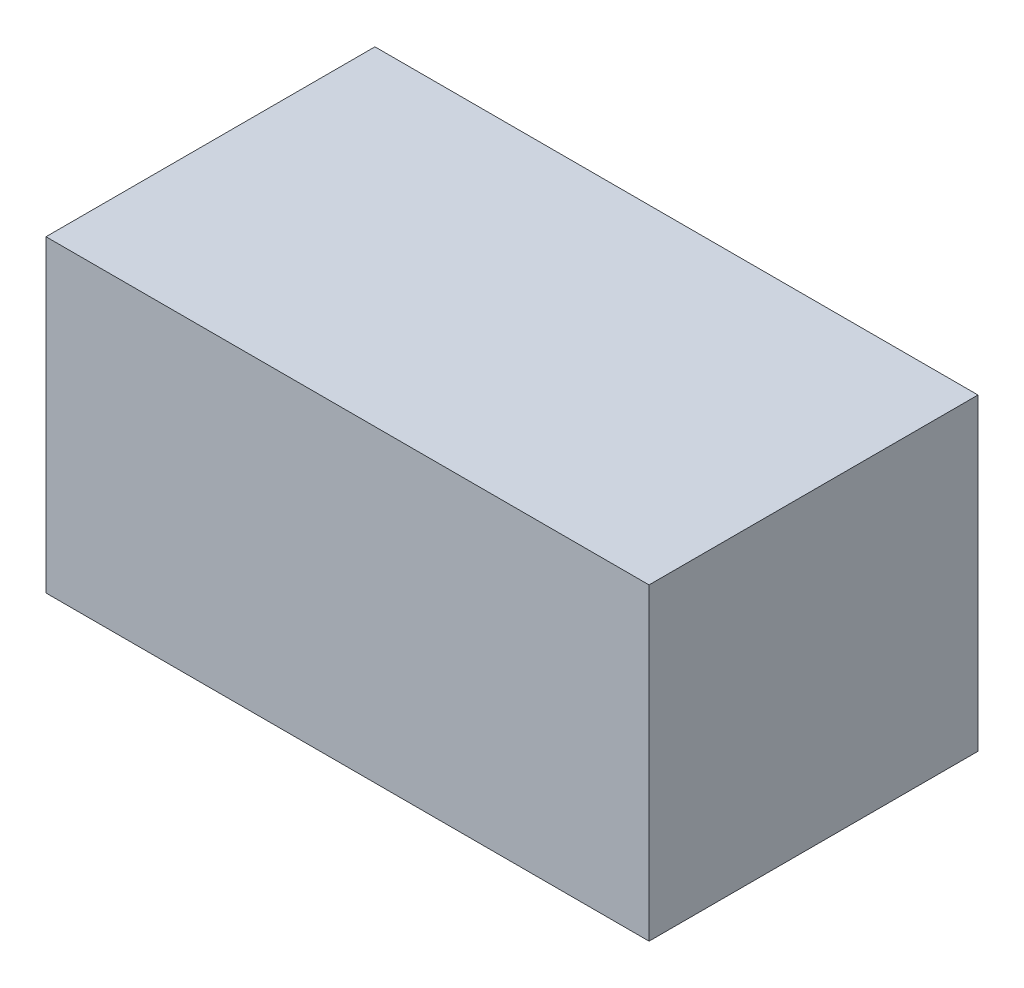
from build123d import *

# Parameters (mm, degrees)
SKETCH1_W      = 110
SKETCH1_H      = 56.283128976
EXTRUDE1_DEPTH = 30


with BuildPart() as part:
    # Sketch1 → Extrude1 (new, symmetric)
    with BuildSketch(Plane.XY):
        with Locations((0, 28.141564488)):
            Rectangle(SKETCH1_W, SKETCH1_H)
    extrude(amount=EXTRUDE1_DEPTH, both=True)


solid = part.part
